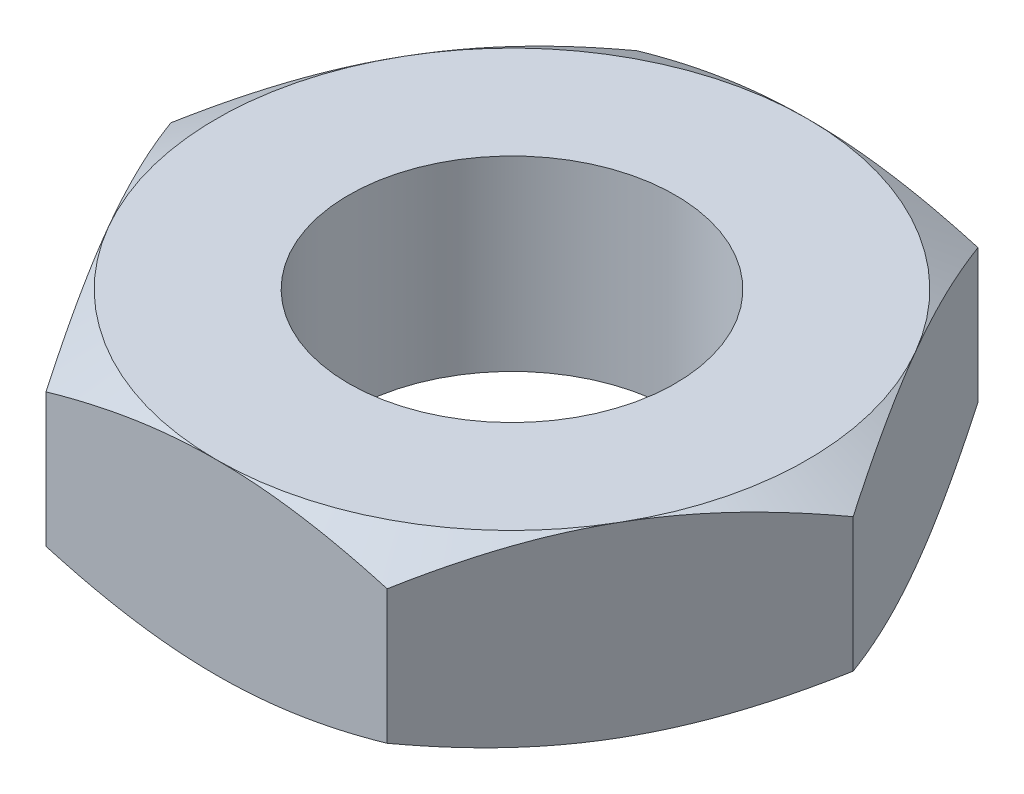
from build123d import *

# Parameters (mm, degrees)
EXTRUDE1_DEPTH         = 6
M12X1_5_TAPPED_HOLE1_D = 10.5


with BuildPart() as part:
    # Sketch1 → Extrude1 (new body)
    with BuildSketch(Plane(origin=(0, 0, 0), x_dir=(1, 0, 0), z_dir=(0, 1, 0))):
        Polygon((5.484827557, -9.5), (10.969655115, 0), (5.484827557, 9.5), (-5.484827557, 9.5), (-10.969655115, 0), (-5.484827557, -9.5), align=None)
    extrude(amount=EXTRUDE1_DEPTH)

    # Sketch2 → Cut-Revolve1 (revolve, cut)
    with BuildSketch(Plane(origin=(0, 0, 0), x_dir=(0, 0, -1), z_dir=(1, 0, 0))):
        Polygon((-9.5, 6), (-12.964101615, 4), (-12.964101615, 6), align=None)
        Polygon((-12.964101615, 0), (-9.5, 0), (-12.964101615, 2), align=None)
    revolve(axis=Axis((0, 0, 0), (0, 1, 0)), mode=Mode.SUBTRACT)

    # M12x1.5 Tapped Hole1 (through all)
    with Locations(Plane(origin=(0, 6, 0), x_dir=(-1, 0, 0), z_dir=(0, 1, 0))):
        with Locations((0, 0)):
            Hole(M12X1_5_TAPPED_HOLE1_D / 2)


solid = part.part
